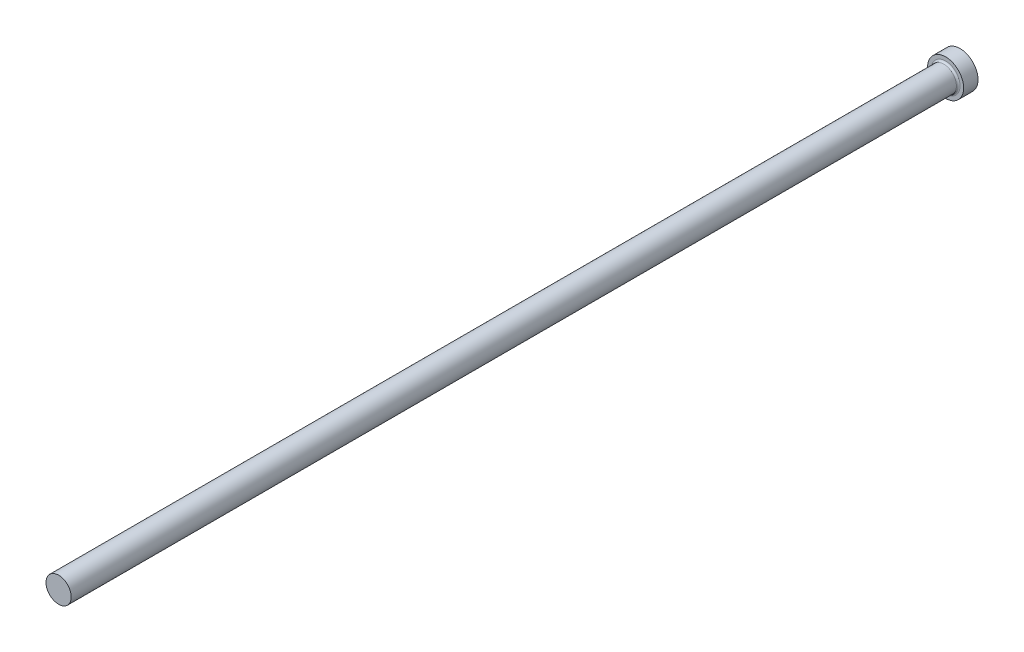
from build123d import *

# Parameters (mm, degrees)
FILLET1_R = 0.5


with BuildPart() as part:
    # FV → Revolve1 (revolve)
    with BuildSketch(Plane(origin=(0, 0, 0), x_dir=(1, 0, 0), z_dir=(0, 1, 0)), mode=Mode.PRIVATE) as revolve1_sk:
        Polygon((0, 0), (5, 0), (5, -4), (3.5, -4), (3.5, -250), (0, -250), align=None)
    revolve(revolve1_sk.sketch.rotate(Axis((0, 0, -9.033228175), (0, 0, 1)), 180), axis=Axis((0, 0, -9.033228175), (0, 0, 1)))

    # Fillet1
    fillet1_edges = [part.edges().sort_by_distance(p)[0] for p in [
        (3.5, 0, 4),
    ]]
    fillet(fillet1_edges, radius=FILLET1_R)


solid = part.part
